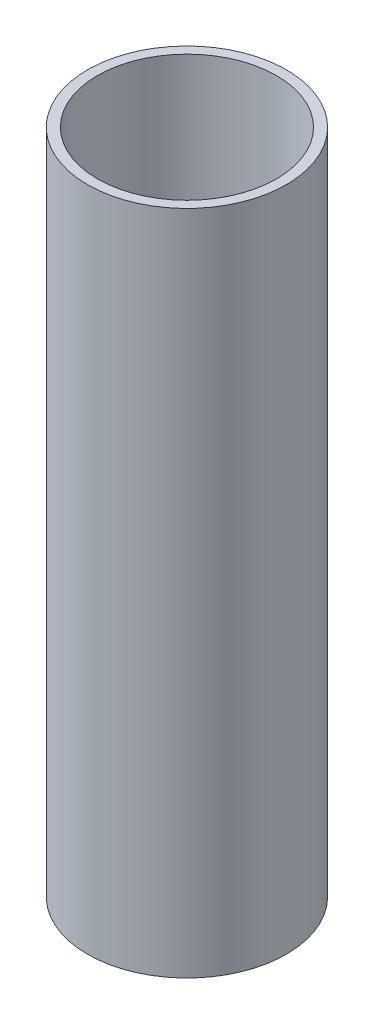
from build123d import *

# Parameters (mm, degrees)
SKETCH1_R      = 40
SKETCH1_R_2    = 36
EXTRUDE1_DEPTH = 268


with BuildPart() as part:
    # Sketch1 → Extrude1 (new body)
    with BuildSketch(Plane(origin=(0, 0, 0), x_dir=(1, 0, 0), z_dir=(0, 1, 0))):
        with Locations(Location((0, 0, 0), (0, 0, 270))):
            Circle(SKETCH1_R)
        with Locations(Location((0, 0, 0), (0, 0, 270))):
            Circle(SKETCH1_R_2, mode=Mode.SUBTRACT)
    extrude(amount=EXTRUDE1_DEPTH)


solid = part.part
